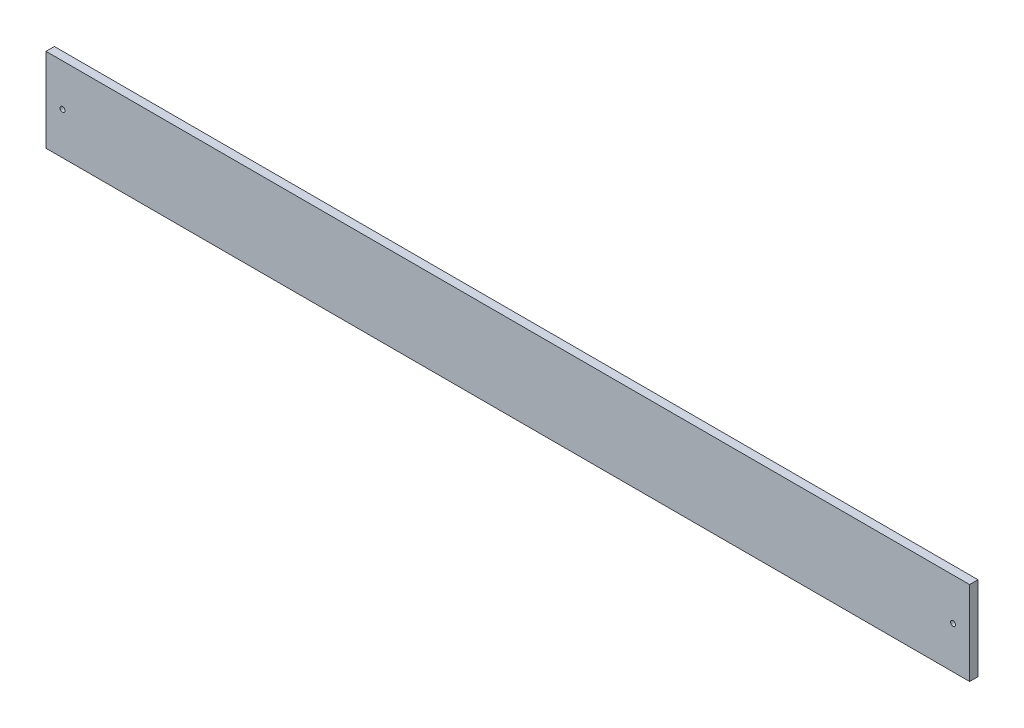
ISO-10303-21;
HEADER;
FILE_DESCRIPTION(('STEP AP214'),'2;1');
FILE_NAME('part.step','',(''),(''),'','','');
FILE_SCHEMA(('AUTOMOTIVE_DESIGN { 1 0 10303 214 1 1 1 1 }'));
ENDSEC;
DATA;
#1=APPLICATION_CONTEXT('core data for automotive mechanical design processes');
#2=APPLICATION_PROTOCOL_DEFINITION('international standard','automotive_design',2000,#1);
#3=PRODUCT_CONTEXT('',#1,'mechanical');
#4=PRODUCT('Part','Part','',(#3));
#5=PRODUCT_RELATED_PRODUCT_CATEGORY('part','',(#4));
#6=PRODUCT_DEFINITION_FORMATION('','',#4);
#7=PRODUCT_DEFINITION_CONTEXT('part definition',#1,'design');
#8=PRODUCT_DEFINITION('design','',#6,#7);
#9=PRODUCT_DEFINITION_SHAPE('','',#8);
#10=(LENGTH_UNIT() NAMED_UNIT(*) SI_UNIT(.MILLI.,.METRE.));
#11=(NAMED_UNIT(*) PLANE_ANGLE_UNIT() SI_UNIT($,.RADIAN.));
#12=(NAMED_UNIT(*) SI_UNIT($,.STERADIAN.) SOLID_ANGLE_UNIT());
#13=UNCERTAINTY_MEASURE_WITH_UNIT(LENGTH_MEASURE(1.E-05),#10,'distance_accuracy_value','');
#14=(GEOMETRIC_REPRESENTATION_CONTEXT(3) GLOBAL_UNCERTAINTY_ASSIGNED_CONTEXT((#13)) GLOBAL_UNIT_ASSIGNED_CONTEXT((#10,
#11,#12)) REPRESENTATION_CONTEXT('',''));
#15=CARTESIAN_POINT('',(0.,0.,0.));
#16=DIRECTION('',(0.,0.,1.));
#17=DIRECTION('',(1.,0.,0.));
#18=AXIS2_PLACEMENT_3D('',#15,#16,#17);
#19=CARTESIAN_POINT('',(275.,25.,5.));
#20=DIRECTION('',(-1.,0.,0.));
#21=DIRECTION('',(0.,0.,1.));
#22=AXIS2_PLACEMENT_3D('',#19,#20,#21);
#23=PLANE('',#22);
#24=DIRECTION('',(0.,1.,0.));
#25=VECTOR('',#24,1.);
#26=CARTESIAN_POINT('',(275.,25.,0.));
#27=LINE('',#26,#25);
#28=CARTESIAN_POINT('',(275.,-25.,0.));
#29=VERTEX_POINT('',#28);
#30=CARTESIAN_POINT('',(275.,25.,0.));
#31=VERTEX_POINT('',#30);
#32=EDGE_CURVE('E96',#29,#31,#27,.T.);
#33=ORIENTED_EDGE('',*,*,#32,.T.);
#34=DIRECTION('',(0.,0.,-1.));
#35=VECTOR('',#34,1.);
#36=CARTESIAN_POINT('',(275.,25.,5.));
#37=LINE('',#36,#35);
#38=CARTESIAN_POINT('',(275.,25.,5.));
#39=VERTEX_POINT('',#38);
#40=EDGE_CURVE('E11',#39,#31,#37,.T.);
#41=ORIENTED_EDGE('',*,*,#40,.F.);
#42=DIRECTION('',(0.,1.,0.));
#43=VECTOR('',#42,1.);
#44=CARTESIAN_POINT('',(275.,25.,5.));
#45=LINE('',#44,#43);
#46=CARTESIAN_POINT('',(275.,-25.,5.));
#47=VERTEX_POINT('',#46);
#48=EDGE_CURVE('E84',#47,#39,#45,.T.);
#49=ORIENTED_EDGE('',*,*,#48,.F.);
#50=DIRECTION('',(0.,0.,-1.));
#51=VECTOR('',#50,1.);
#52=CARTESIAN_POINT('',(275.,-25.,5.));
#53=LINE('',#52,#51);
#54=EDGE_CURVE('E92',#47,#29,#53,.T.);
#55=ORIENTED_EDGE('',*,*,#54,.T.);
#56=EDGE_LOOP('',(#33,#41,#49,#55));
#57=FACE_BOUND('',#56,.T.);
#58=ADVANCED_FACE('F33',(#57),#23,.F.);
#59=CARTESIAN_POINT('',(-275.,25.,5.));
#60=DIRECTION('',(0.,-1.,0.));
#61=DIRECTION('',(0.,0.,-1.));
#62=AXIS2_PLACEMENT_3D('',#59,#60,#61);
#63=PLANE('',#62);
#64=DIRECTION('',(-1.,0.,0.));
#65=VECTOR('',#64,1.);
#66=CARTESIAN_POINT('',(-275.,25.,0.));
#67=LINE('',#66,#65);
#68=CARTESIAN_POINT('',(-275.,25.,0.));
#69=VERTEX_POINT('',#68);
#70=EDGE_CURVE('E88',#31,#69,#67,.T.);
#71=ORIENTED_EDGE('',*,*,#70,.T.);
#72=DIRECTION('',(0.,0.,-1.));
#73=VECTOR('',#72,1.);
#74=CARTESIAN_POINT('',(-275.,25.,5.));
#75=LINE('',#74,#73);
#76=CARTESIAN_POINT('',(-275.,25.,5.));
#77=VERTEX_POINT('',#76);
#78=EDGE_CURVE('E41',#77,#69,#75,.T.);
#79=ORIENTED_EDGE('',*,*,#78,.F.);
#80=DIRECTION('',(-1.,0.,0.));
#81=VECTOR('',#80,1.);
#82=CARTESIAN_POINT('',(-275.,25.,5.));
#83=LINE('',#82,#81);
#84=EDGE_CURVE('E79',#39,#77,#83,.T.);
#85=ORIENTED_EDGE('',*,*,#84,.F.);
#86=ORIENTED_EDGE('',*,*,#40,.T.);
#87=EDGE_LOOP('',(#71,#79,#85,#86));
#88=FACE_BOUND('',#87,.T.);
#89=ADVANCED_FACE('F87',(#88),#63,.F.);
#90=CARTESIAN_POINT('',(-275.,25.,5.));
#91=DIRECTION('',(1.,0.,0.));
#92=DIRECTION('',(0.,0.,-1.));
#93=AXIS2_PLACEMENT_3D('',#90,#91,#92);
#94=PLANE('',#93);
#95=DIRECTION('',(0.,-1.,0.));
#96=VECTOR('',#95,1.);
#97=CARTESIAN_POINT('',(-275.,25.,0.));
#98=LINE('',#97,#96);
#99=CARTESIAN_POINT('',(-275.,-25.,0.));
#100=VERTEX_POINT('',#99);
#101=EDGE_CURVE('E66',#69,#100,#98,.T.);
#102=ORIENTED_EDGE('',*,*,#101,.T.);
#103=DIRECTION('',(0.,0.,-1.));
#104=VECTOR('',#103,1.);
#105=CARTESIAN_POINT('',(-275.,-25.,5.));
#106=LINE('',#105,#104);
#107=CARTESIAN_POINT('',(-275.,-25.,5.));
#108=VERTEX_POINT('',#107);
#109=EDGE_CURVE('E89',#108,#100,#106,.T.);
#110=ORIENTED_EDGE('',*,*,#109,.F.);
#111=DIRECTION('',(0.,-1.,0.));
#112=VECTOR('',#111,1.);
#113=CARTESIAN_POINT('',(-275.,25.,5.));
#114=LINE('',#113,#112);
#115=EDGE_CURVE('E82',#77,#108,#114,.T.);
#116=ORIENTED_EDGE('',*,*,#115,.F.);
#117=ORIENTED_EDGE('',*,*,#78,.T.);
#118=EDGE_LOOP('',(#102,#110,#116,#117));
#119=FACE_BOUND('',#118,.T.);
#120=ADVANCED_FACE('F90',(#119),#94,.F.);
#121=CARTESIAN_POINT('',(-275.,-25.,5.));
#122=DIRECTION('',(0.,1.,0.));
#123=DIRECTION('',(0.,0.,1.));
#124=AXIS2_PLACEMENT_3D('',#121,#122,#123);
#125=PLANE('',#124);
#126=DIRECTION('',(1.,0.,0.));
#127=VECTOR('',#126,1.);
#128=CARTESIAN_POINT('',(-275.,-25.,0.));
#129=LINE('',#128,#127);
#130=EDGE_CURVE('E72',#100,#29,#129,.T.);
#131=ORIENTED_EDGE('',*,*,#130,.T.);
#132=ORIENTED_EDGE('',*,*,#54,.F.);
#133=DIRECTION('',(1.,0.,0.));
#134=VECTOR('',#133,1.);
#135=CARTESIAN_POINT('',(-275.,-25.,5.));
#136=LINE('',#135,#134);
#137=EDGE_CURVE('E49',#108,#47,#136,.T.);
#138=ORIENTED_EDGE('',*,*,#137,.F.);
#139=ORIENTED_EDGE('',*,*,#109,.T.);
#140=EDGE_LOOP('',(#131,#132,#138,#139));
#141=FACE_BOUND('',#140,.T.);
#142=ADVANCED_FACE('F104',(#141),#125,.F.);
#143=CARTESIAN_POINT('',(0.,0.,5.));
#144=DIRECTION('',(0.,0.,1.));
#145=DIRECTION('',(1.,0.,0.));
#146=AXIS2_PLACEMENT_3D('',#143,#144,#145);
#147=PLANE('',#146);
#148=CARTESIAN_POINT('',(-265.165,0.,5.));
#149=DIRECTION('',(0.,0.,-1.));
#150=DIRECTION('',(-1.,0.,0.));
#151=AXIS2_PLACEMENT_3D('',#148,#149,#150);
#152=CIRCLE('',#151,1.50000000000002);
#153=CARTESIAN_POINT('',(-266.665,0.,5.));
#154=VERTEX_POINT('',#153);
#155=EDGE_CURVE('E116',#154,#154,#152,.T.);
#156=ORIENTED_EDGE('',*,*,#155,.T.);
#157=EDGE_LOOP('',(#156));
#158=FACE_BOUND('',#157,.T.);
#159=CARTESIAN_POINT('',(265.165,0.,5.));
#160=DIRECTION('',(0.,0.,1.));
#161=DIRECTION('',(1.,0.,0.));
#162=AXIS2_PLACEMENT_3D('',#159,#160,#161);
#163=CIRCLE('',#162,1.50000000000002);
#164=CARTESIAN_POINT('',(266.665,0.,5.));
#165=VERTEX_POINT('',#164);
#166=EDGE_CURVE('E110',#165,#165,#163,.T.);
#167=ORIENTED_EDGE('',*,*,#166,.F.);
#168=EDGE_LOOP('',(#167));
#169=FACE_BOUND('',#168,.T.);
#170=ORIENTED_EDGE('',*,*,#48,.T.);
#171=ORIENTED_EDGE('',*,*,#84,.T.);
#172=ORIENTED_EDGE('',*,*,#115,.T.);
#173=ORIENTED_EDGE('',*,*,#137,.T.);
#174=EDGE_LOOP('',(#170,#171,#172,#173));
#175=FACE_BOUND('',#174,.T.);
#176=ADVANCED_FACE('F80',(#158,#169,#175),#147,.T.);
#177=CARTESIAN_POINT('',(0.,0.,0.));
#178=DIRECTION('',(0.,0.,1.));
#179=DIRECTION('',(1.,0.,0.));
#180=AXIS2_PLACEMENT_3D('',#177,#178,#179);
#181=PLANE('',#180);
#182=CARTESIAN_POINT('',(-265.165,0.,0.));
#183=DIRECTION('',(0.,0.,-1.));
#184=DIRECTION('',(-1.,0.,0.));
#185=AXIS2_PLACEMENT_3D('',#182,#183,#184);
#186=CIRCLE('',#185,1.50000000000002);
#187=CARTESIAN_POINT('',(-266.665,0.,0.));
#188=VERTEX_POINT('',#187);
#189=EDGE_CURVE('E113',#188,#188,#186,.T.);
#190=ORIENTED_EDGE('',*,*,#189,.F.);
#191=EDGE_LOOP('',(#190));
#192=FACE_BOUND('',#191,.T.);
#193=CARTESIAN_POINT('',(265.165,0.,0.));
#194=DIRECTION('',(0.,0.,1.));
#195=DIRECTION('',(1.,0.,0.));
#196=AXIS2_PLACEMENT_3D('',#193,#194,#195);
#197=CIRCLE('',#196,1.50000000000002);
#198=CARTESIAN_POINT('',(266.665,0.,0.));
#199=VERTEX_POINT('',#198);
#200=EDGE_CURVE('E99',#199,#199,#197,.T.);
#201=ORIENTED_EDGE('',*,*,#200,.T.);
#202=EDGE_LOOP('',(#201));
#203=FACE_BOUND('',#202,.T.);
#204=ORIENTED_EDGE('',*,*,#32,.F.);
#205=ORIENTED_EDGE('',*,*,#130,.F.);
#206=ORIENTED_EDGE('',*,*,#101,.F.);
#207=ORIENTED_EDGE('',*,*,#70,.F.);
#208=EDGE_LOOP('',(#204,#205,#206,#207));
#209=FACE_BOUND('',#208,.T.);
#210=ADVANCED_FACE('F107',(#192,#203,#209),#181,.F.);
#211=CARTESIAN_POINT('',(265.165,0.,0.));
#212=DIRECTION('',(0.,0.,1.));
#213=DIRECTION('',(1.,0.,0.));
#214=AXIS2_PLACEMENT_3D('',#211,#212,#213);
#215=CYLINDRICAL_SURFACE('',#214,1.50000000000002);
#216=ORIENTED_EDGE('',*,*,#200,.F.);
#217=EDGE_LOOP('',(#216));
#218=FACE_BOUND('',#217,.T.);
#219=ORIENTED_EDGE('',*,*,#166,.T.);
#220=EDGE_LOOP('',(#219));
#221=FACE_BOUND('',#220,.T.);
#222=ADVANCED_FACE('F127',(#218,#221),#215,.F.);
#223=CARTESIAN_POINT('',(-265.165,0.,0.));
#224=DIRECTION('',(0.,0.,1.));
#225=DIRECTION('',(1.,0.,0.));
#226=AXIS2_PLACEMENT_3D('',#223,#224,#225);
#227=CYLINDRICAL_SURFACE('',#226,1.50000000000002);
#228=ORIENTED_EDGE('',*,*,#189,.T.);
#229=EDGE_LOOP('',(#228));
#230=FACE_BOUND('',#229,.T.);
#231=ORIENTED_EDGE('',*,*,#155,.F.);
#232=EDGE_LOOP('',(#231));
#233=FACE_BOUND('',#232,.T.);
#234=ADVANCED_FACE('F122',(#230,#233),#227,.F.);
#235=CLOSED_SHELL('',(#58,#89,#120,#142,#176,#210,#222,#234));
#236=MANIFOLD_SOLID_BREP('B2',#235);
#237=ADVANCED_BREP_SHAPE_REPRESENTATION('',(#18,#236),#14);
#238=SHAPE_DEFINITION_REPRESENTATION(#9,#237);
ENDSEC;
END-ISO-10303-21;
